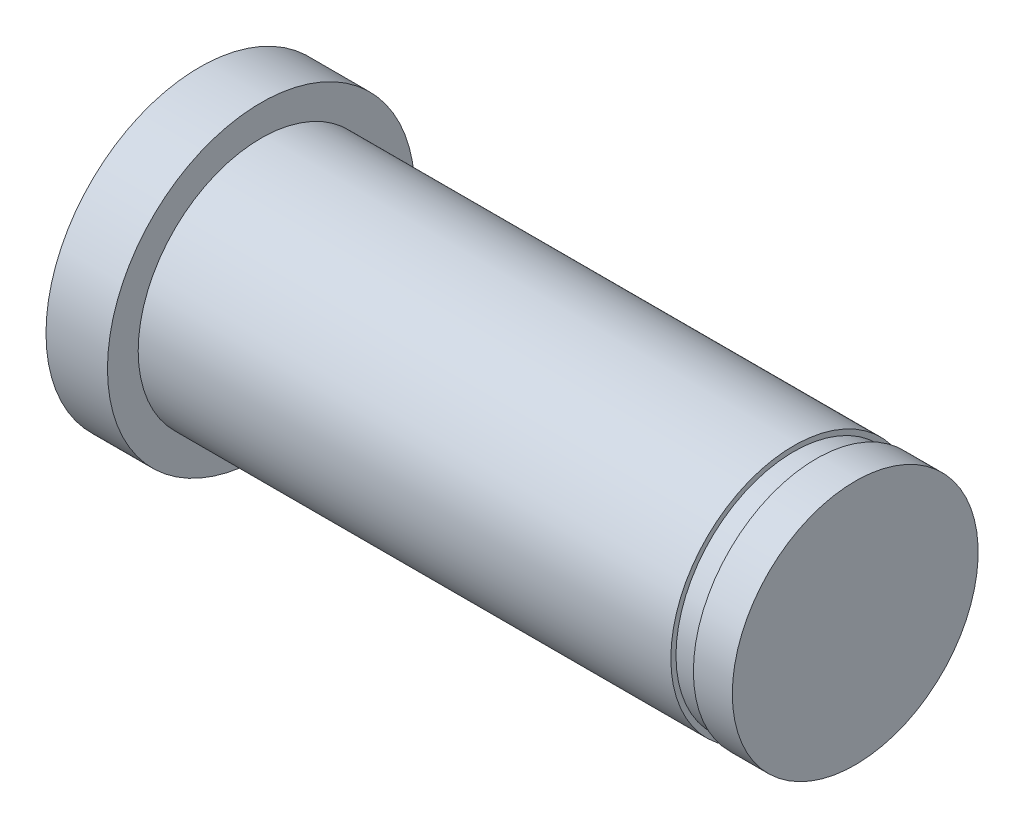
ISO-10303-21;
HEADER;
FILE_DESCRIPTION(('STEP AP214'),'2;1');
FILE_NAME('part.step','',(''),(''),'','','');
FILE_SCHEMA(('AUTOMOTIVE_DESIGN { 1 0 10303 214 1 1 1 1 }'));
ENDSEC;
DATA;
#1=APPLICATION_CONTEXT('core data for automotive mechanical design processes');
#2=APPLICATION_PROTOCOL_DEFINITION('international standard','automotive_design',2000,#1);
#3=PRODUCT_CONTEXT('',#1,'mechanical');
#4=PRODUCT('Part','Part','',(#3));
#5=PRODUCT_RELATED_PRODUCT_CATEGORY('part','',(#4));
#6=PRODUCT_DEFINITION_FORMATION('','',#4);
#7=PRODUCT_DEFINITION_CONTEXT('part definition',#1,'design');
#8=PRODUCT_DEFINITION('design','',#6,#7);
#9=PRODUCT_DEFINITION_SHAPE('','',#8);
#10=(LENGTH_UNIT() NAMED_UNIT(*) SI_UNIT(.MILLI.,.METRE.));
#11=(NAMED_UNIT(*) PLANE_ANGLE_UNIT() SI_UNIT($,.RADIAN.));
#12=(NAMED_UNIT(*) SI_UNIT($,.STERADIAN.) SOLID_ANGLE_UNIT());
#13=UNCERTAINTY_MEASURE_WITH_UNIT(LENGTH_MEASURE(1.E-05),#10,'distance_accuracy_value','');
#14=(GEOMETRIC_REPRESENTATION_CONTEXT(3) GLOBAL_UNCERTAINTY_ASSIGNED_CONTEXT((#13)) GLOBAL_UNIT_ASSIGNED_CONTEXT((#10,
#11,#12)) REPRESENTATION_CONTEXT('',''));
#15=CARTESIAN_POINT('',(0.,0.,0.));
#16=DIRECTION('',(0.,0.,1.));
#17=DIRECTION('',(1.,0.,0.));
#18=AXIS2_PLACEMENT_3D('',#15,#16,#17);
#19=CARTESIAN_POINT('',(0.,0.,0.));
#20=DIRECTION('',(1.,0.,0.));
#21=DIRECTION('',(0.,0.,-1.));
#22=AXIS2_PLACEMENT_3D('',#19,#20,#21);
#23=PLANE('',#22);
#24=CARTESIAN_POINT('',(0.,0.,0.));
#25=DIRECTION('',(-1.,0.,0.));
#26=DIRECTION('',(0.,0.,1.));
#27=AXIS2_PLACEMENT_3D('',#24,#25,#26);
#28=CIRCLE('',#27,7.49999999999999);
#29=CARTESIAN_POINT('',(0.,0.,7.49999999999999));
#30=VERTEX_POINT('',#29);
#31=EDGE_CURVE('E10',#30,#30,#28,.T.);
#32=ORIENTED_EDGE('',*,*,#31,.T.);
#33=EDGE_LOOP('',(#32));
#34=FACE_BOUND('',#33,.T.);
#35=ADVANCED_FACE('F34',(#34),#23,.F.);
#36=CARTESIAN_POINT('',(0.,0.,0.));
#37=DIRECTION('',(-1.,0.,0.));
#38=DIRECTION('',(0.,0.,1.));
#39=AXIS2_PLACEMENT_3D('',#36,#37,#38);
#40=CYLINDRICAL_SURFACE('',#39,7.49999999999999);
#41=ORIENTED_EDGE('',*,*,#31,.F.);
#42=EDGE_LOOP('',(#41));
#43=FACE_BOUND('',#42,.T.);
#44=CARTESIAN_POINT('',(3.,0.,0.));
#45=DIRECTION('',(-1.,0.,0.));
#46=DIRECTION('',(0.,0.,1.));
#47=AXIS2_PLACEMENT_3D('',#44,#45,#46);
#48=CIRCLE('',#47,7.49999999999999);
#49=CARTESIAN_POINT('',(3.,0.,7.49999999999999));
#50=VERTEX_POINT('',#49);
#51=EDGE_CURVE('E40',#50,#50,#48,.T.);
#52=ORIENTED_EDGE('',*,*,#51,.T.);
#53=EDGE_LOOP('',(#52));
#54=FACE_BOUND('',#53,.T.);
#55=ADVANCED_FACE('F78',(#43,#54),#40,.T.);
#56=CARTESIAN_POINT('',(3.,7.49999999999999,0.));
#57=DIRECTION('',(-1.,0.,0.));
#58=DIRECTION('',(0.,0.,1.));
#59=AXIS2_PLACEMENT_3D('',#56,#57,#58);
#60=PLANE('',#59);
#61=ORIENTED_EDGE('',*,*,#51,.F.);
#62=EDGE_LOOP('',(#61));
#63=FACE_BOUND('',#62,.T.);
#64=CARTESIAN_POINT('',(3.,0.,0.));
#65=DIRECTION('',(-1.,0.,0.));
#66=DIRECTION('',(0.,0.,1.));
#67=AXIS2_PLACEMENT_3D('',#64,#65,#66);
#68=CIRCLE('',#67,6.);
#69=CARTESIAN_POINT('',(3.,0.,6.));
#70=VERTEX_POINT('',#69);
#71=EDGE_CURVE('E44',#70,#70,#68,.T.);
#72=ORIENTED_EDGE('',*,*,#71,.T.);
#73=EDGE_LOOP('',(#72));
#74=FACE_BOUND('',#73,.T.);
#75=ADVANCED_FACE('F82',(#63,#74),#60,.F.);
#76=CARTESIAN_POINT('',(0.,0.,0.));
#77=DIRECTION('',(-1.,0.,0.));
#78=DIRECTION('',(0.,0.,1.));
#79=AXIS2_PLACEMENT_3D('',#76,#77,#78);
#80=CYLINDRICAL_SURFACE('',#79,6.);
#81=ORIENTED_EDGE('',*,*,#71,.F.);
#82=EDGE_LOOP('',(#81));
#83=FACE_BOUND('',#82,.T.);
#84=CARTESIAN_POINT('',(29.,0.,0.));
#85=DIRECTION('',(-1.,0.,0.));
#86=DIRECTION('',(0.,0.,1.));
#87=AXIS2_PLACEMENT_3D('',#84,#85,#86);
#88=CIRCLE('',#87,6.);
#89=CARTESIAN_POINT('',(29.,0.,6.));
#90=VERTEX_POINT('',#89);
#91=EDGE_CURVE('E48',#90,#90,#88,.T.);
#92=ORIENTED_EDGE('',*,*,#91,.T.);
#93=EDGE_LOOP('',(#92));
#94=FACE_BOUND('',#93,.T.);
#95=ADVANCED_FACE('F87',(#83,#94),#80,.T.);
#96=CARTESIAN_POINT('',(29.,6.,0.));
#97=DIRECTION('',(-1.,0.,0.));
#98=DIRECTION('',(0.,0.,1.));
#99=AXIS2_PLACEMENT_3D('',#96,#97,#98);
#100=PLANE('',#99);
#101=ORIENTED_EDGE('',*,*,#91,.F.);
#102=EDGE_LOOP('',(#101));
#103=FACE_BOUND('',#102,.T.);
#104=CARTESIAN_POINT('',(29.,0.,0.));
#105=DIRECTION('',(-1.,0.,0.));
#106=DIRECTION('',(0.,0.,1.));
#107=AXIS2_PLACEMENT_3D('',#104,#105,#106);
#108=CIRCLE('',#107,5.75);
#109=CARTESIAN_POINT('',(29.,0.,5.75));
#110=VERTEX_POINT('',#109);
#111=EDGE_CURVE('E53',#110,#110,#108,.T.);
#112=ORIENTED_EDGE('',*,*,#111,.T.);
#113=EDGE_LOOP('',(#112));
#114=FACE_BOUND('',#113,.T.);
#115=ADVANCED_FACE('F93',(#103,#114),#100,.F.);
#116=CARTESIAN_POINT('',(0.,0.,0.));
#117=DIRECTION('',(-1.,0.,0.));
#118=DIRECTION('',(0.,0.,1.));
#119=AXIS2_PLACEMENT_3D('',#116,#117,#118);
#120=CYLINDRICAL_SURFACE('',#119,5.75);
#121=ORIENTED_EDGE('',*,*,#111,.F.);
#122=EDGE_LOOP('',(#121));
#123=FACE_BOUND('',#122,.T.);
#124=CARTESIAN_POINT('',(30.1,0.,0.));
#125=DIRECTION('',(-1.,0.,0.));
#126=DIRECTION('',(0.,0.,1.));
#127=AXIS2_PLACEMENT_3D('',#124,#125,#126);
#128=CIRCLE('',#127,5.75);
#129=CARTESIAN_POINT('',(30.1,0.,5.75));
#130=VERTEX_POINT('',#129);
#131=EDGE_CURVE('E56',#130,#130,#128,.T.);
#132=ORIENTED_EDGE('',*,*,#131,.T.);
#133=EDGE_LOOP('',(#132));
#134=FACE_BOUND('',#133,.T.);
#135=ADVANCED_FACE('F97',(#123,#134),#120,.T.);
#136=CARTESIAN_POINT('',(30.1,6.,0.));
#137=DIRECTION('',(1.,0.,0.));
#138=DIRECTION('',(0.,0.,-1.));
#139=AXIS2_PLACEMENT_3D('',#136,#137,#138);
#140=PLANE('',#139);
#141=ORIENTED_EDGE('',*,*,#131,.F.);
#142=EDGE_LOOP('',(#141));
#143=FACE_BOUND('',#142,.T.);
#144=CARTESIAN_POINT('',(30.1,0.,0.));
#145=DIRECTION('',(-1.,0.,0.));
#146=DIRECTION('',(0.,0.,1.));
#147=AXIS2_PLACEMENT_3D('',#144,#145,#146);
#148=CIRCLE('',#147,6.);
#149=CARTESIAN_POINT('',(30.1,0.,6.));
#150=VERTEX_POINT('',#149);
#151=EDGE_CURVE('E59',#150,#150,#148,.T.);
#152=ORIENTED_EDGE('',*,*,#151,.T.);
#153=EDGE_LOOP('',(#152));
#154=FACE_BOUND('',#153,.T.);
#155=ADVANCED_FACE('F74',(#143,#154),#140,.F.);
#156=CARTESIAN_POINT('',(0.,0.,0.));
#157=DIRECTION('',(-1.,0.,0.));
#158=DIRECTION('',(0.,0.,1.));
#159=AXIS2_PLACEMENT_3D('',#156,#157,#158);
#160=CYLINDRICAL_SURFACE('',#159,6.);
#161=ORIENTED_EDGE('',*,*,#151,.F.);
#162=EDGE_LOOP('',(#161));
#163=FACE_BOUND('',#162,.T.);
#164=CARTESIAN_POINT('',(32.,0.,0.));
#165=DIRECTION('',(-1.,0.,0.));
#166=DIRECTION('',(0.,0.,1.));
#167=AXIS2_PLACEMENT_3D('',#164,#165,#166);
#168=CIRCLE('',#167,6.);
#169=CARTESIAN_POINT('',(32.,0.,6.));
#170=VERTEX_POINT('',#169);
#171=EDGE_CURVE('E62',#170,#170,#168,.T.);
#172=ORIENTED_EDGE('',*,*,#171,.T.);
#173=EDGE_LOOP('',(#172));
#174=FACE_BOUND('',#173,.T.);
#175=ADVANCED_FACE('F66',(#163,#174),#160,.T.);
#176=CARTESIAN_POINT('',(32.,6.,0.));
#177=DIRECTION('',(-1.,0.,0.));
#178=DIRECTION('',(0.,0.,1.));
#179=AXIS2_PLACEMENT_3D('',#176,#177,#178);
#180=PLANE('',#179);
#181=ORIENTED_EDGE('',*,*,#171,.F.);
#182=EDGE_LOOP('',(#181));
#183=FACE_BOUND('',#182,.T.);
#184=ADVANCED_FACE('F68',(#183),#180,.F.);
#185=CLOSED_SHELL('',(#35,#55,#75,#95,#115,#135,#155,#175,#184));
#186=MANIFOLD_SOLID_BREP('B2',#185);
#187=ADVANCED_BREP_SHAPE_REPRESENTATION('',(#18,#186),#14);
#188=SHAPE_DEFINITION_REPRESENTATION(#9,#187);
ENDSEC;
END-ISO-10303-21;
